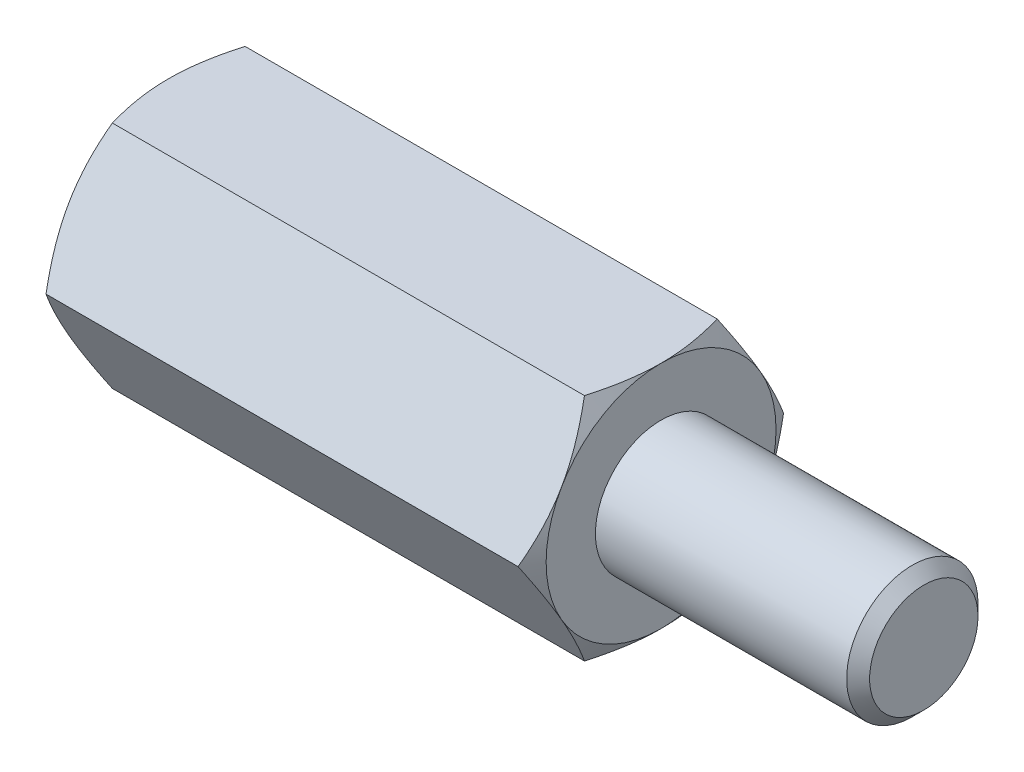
from build123d import *

# Parameters (mm, degrees)
EXTRUDE2_DEPTH = 7.5
SKETCH3_R      = 1.65
EXTRUDE3_DEPTH = 8
SKETCH5_R      = 2
EXTRUDE4_DEPTH = 8
CHAMFER1_SIZE  = 0.35


with BuildPart() as part:
    # Sketch1 → Extrude2 (new, symmetric)
    with BuildSketch(Plane(origin=(0, 0, 0), x_dir=(0, 0, -1), z_dir=(1, 0, 0))):
        Polygon((2.020725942, 3.5), (-2.020725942, 3.5), (-4.041451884, 0), (-2.020725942, -3.5), (2.020725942, -3.5), (4.041451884, 0), align=None)
    extrude(amount=EXTRUDE2_DEPTH, both=True)

    # Sketch2 → Cut-Revolve1 (revolve, cut)
    with BuildSketch(Plane.XY):
        with BuildLine():
            Line((-7.5, 3.5), (-6, 6.098076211))
            ThreePointArc((-6, 6.098076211), (-6.48810136, 7.276457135), (-7.5, 6.5))
            Line((-7.5, 6.5), (-7.5, 3.5))
        make_face()
    cut_revolve1 = revolve(axis=Axis((0, 0, 0), (1, 0, 0)), mode=Mode.SUBTRACT)

    # Mirror1: Cut-Revolve1 across plane
    add(cut_revolve1.mirror(Plane(origin=(0, 0, 0), x_dir=(0, 0, 1), z_dir=(1, 0, 0))), mode=Mode.SUBTRACT)

    # Sketch3 → Extrude3 (cut)
    with BuildSketch(Plane.ZY.offset(7.5)):
        Circle(SKETCH3_R)
    extrude(amount=-EXTRUDE3_DEPTH, mode=Mode.SUBTRACT)

    # Sketch4 → Cut-Revolve2 (revolve, cut)
    with BuildSketch(Plane.XY, mode=Mode.PRIVATE) as cut_revolve2_sk:
        Polygon((0.5, 0), (0.5, 1.65), (1.452627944, 0), align=None)
    revolve(cut_revolve2_sk.sketch.rotate(Axis((1.452627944, 0, 0), (-1, 0, 0)), 270), axis=Axis((1.452627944, 0, 0), (-1, 0, 0)), mode=Mode.SUBTRACT)

    # Sketch5 → Extrude4 (add)
    with BuildSketch(Plane(origin=(7.5, 0, 0), x_dir=(0, 0, -1), z_dir=(1, 0, 0))):
        Circle(SKETCH5_R)
    extrude(amount=EXTRUDE4_DEPTH)

    # Chamfer1
    chamfer1_edges = [part.edges().sort_by_distance(p)[0] for p in [
        (15.5, 0, 2),
    ]]
    chamfer(chamfer1_edges, length=CHAMFER1_SIZE)


solid = part.part
